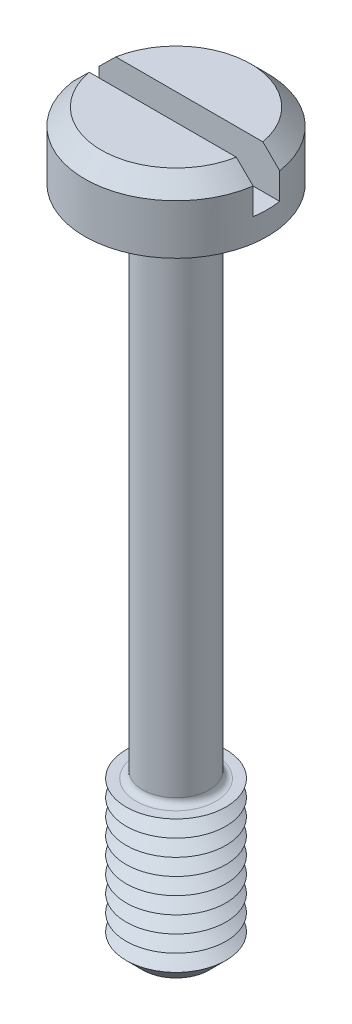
ISO-10303-21;
HEADER;
FILE_DESCRIPTION(('STEP AP214'),'2;1');
FILE_NAME('part.step','',(''),(''),'','','');
FILE_SCHEMA(('AUTOMOTIVE_DESIGN { 1 0 10303 214 1 1 1 1 }'));
ENDSEC;
DATA;
#1=APPLICATION_CONTEXT('core data for automotive mechanical design processes');
#2=APPLICATION_PROTOCOL_DEFINITION('international standard','automotive_design',2000,#1);
#3=PRODUCT_CONTEXT('',#1,'mechanical');
#4=PRODUCT('Part','Part','',(#3));
#5=PRODUCT_RELATED_PRODUCT_CATEGORY('part','',(#4));
#6=PRODUCT_DEFINITION_FORMATION('','',#4);
#7=PRODUCT_DEFINITION_CONTEXT('part definition',#1,'design');
#8=PRODUCT_DEFINITION('design','',#6,#7);
#9=PRODUCT_DEFINITION_SHAPE('','',#8);
#10=(LENGTH_UNIT() NAMED_UNIT(*) SI_UNIT(.MILLI.,.METRE.));
#11=(NAMED_UNIT(*) PLANE_ANGLE_UNIT() SI_UNIT($,.RADIAN.));
#12=(NAMED_UNIT(*) SI_UNIT($,.STERADIAN.) SOLID_ANGLE_UNIT());
#13=UNCERTAINTY_MEASURE_WITH_UNIT(LENGTH_MEASURE(1.E-05),#10,'distance_accuracy_value','');
#14=(GEOMETRIC_REPRESENTATION_CONTEXT(3) GLOBAL_UNCERTAINTY_ASSIGNED_CONTEXT((#13)) GLOBAL_UNIT_ASSIGNED_CONTEXT((#10,
#11,#12)) REPRESENTATION_CONTEXT('',''));
#15=CARTESIAN_POINT('',(0.,0.,0.));
#16=DIRECTION('',(0.,0.,1.));
#17=DIRECTION('',(1.,0.,0.));
#18=AXIS2_PLACEMENT_3D('',#15,#16,#17);
#19=CARTESIAN_POINT('',(0.,2.,0.));
#20=DIRECTION('',(0.,1.,0.));
#21=DIRECTION('',(0.,0.,1.));
#22=AXIS2_PLACEMENT_3D('',#19,#20,#21);
#23=PLANE('',#22);
#24=DIRECTION('',(-1.,0.,0.));
#25=VECTOR('',#24,1.);
#26=CARTESIAN_POINT('',(2.75,2.,-0.4));
#27=LINE('',#26,#25);
#28=CARTESIAN_POINT('',(2.21415898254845,2.,-0.4));
#29=VERTEX_POINT('',#28);
#30=CARTESIAN_POINT('',(-2.21415898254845,2.,-0.4));
#31=VERTEX_POINT('',#30);
#32=EDGE_CURVE('E110',#29,#31,#27,.T.);
#33=ORIENTED_EDGE('',*,*,#32,.F.);
#34=CARTESIAN_POINT('',(0.,2.,0.));
#35=DIRECTION('',(0.,1.,0.));
#36=DIRECTION('',(0.,0.,1.));
#37=AXIS2_PLACEMENT_3D('',#34,#35,#36);
#38=CIRCLE('',#37,2.25);
#39=EDGE_CURVE('E113',#29,#31,#38,.T.);
#40=ORIENTED_EDGE('',*,*,#39,.T.);
#41=EDGE_LOOP('',(#33,#40));
#42=FACE_BOUND('',#41,.T.);
#43=ADVANCED_FACE('F39',(#42),#23,.T.);
#44=CARTESIAN_POINT('',(0.,2.,0.));
#45=DIRECTION('',(0.,-1.,0.));
#46=DIRECTION('',(0.,0.,-1.));
#47=AXIS2_PLACEMENT_3D('',#44,#45,#46);
#48=CONICAL_SURFACE('',#47,2.25,0.785398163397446);
#49=CARTESIAN_POINT('',(6.05060089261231,-1.81380830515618,-0.4));
#50=CARTESIAN_POINT('',(5.84217393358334,-1.60583904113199,-0.4));
#51=CARTESIAN_POINT('',(5.63372707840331,-1.3978896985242,-0.4));
#52=CARTESIAN_POINT('',(5.21676338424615,-0.982052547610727,-0.4));
#53=CARTESIAN_POINT('',(5.00824654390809,-0.774164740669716,-0.4));
#54=CARTESIAN_POINT('',(4.59102343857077,-0.358383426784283,-0.4));
#55=CARTESIAN_POINT('',(4.38231713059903,-0.150489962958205,-0.4));
#56=CARTESIAN_POINT('',(3.96477014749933,0.265153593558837,-0.4));
#57=CARTESIAN_POINT('',(3.75592947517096,0.472903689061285,-0.4));
#58=CARTESIAN_POINT('',(3.33589913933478,0.89028798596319,-0.4));
#59=CARTESIAN_POINT('',(3.12470717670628,1.09991987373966,-0.4));
#60=CARTESIAN_POINT('',(2.7019134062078,1.51879562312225,-0.4));
#61=CARTESIAN_POINT('',(2.49031157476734,1.72803946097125,-0.4));
#62=CARTESIAN_POINT('',(2.17231429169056,2.04123939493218,-0.4));
#63=CARTESIAN_POINT('',(2.06623184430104,2.14551302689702,-0.4));
#64=CARTESIAN_POINT('',(1.85373145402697,2.35372301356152,-0.4));
#65=CARTESIAN_POINT('',(1.74731350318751,2.45765936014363,-0.4));
#66=CARTESIAN_POINT('',(1.53394692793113,2.6649644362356,-0.4));
#67=CARTESIAN_POINT('',(1.42699836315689,2.76833322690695,-0.4));
#68=CARTESIAN_POINT('',(1.26580938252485,2.92258234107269,-0.4));
#69=CARTESIAN_POINT('',(1.21195308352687,2.97386371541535,-0.4));
#70=CARTESIAN_POINT('',(1.10386632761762,3.07603025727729,-0.4));
#71=CARTESIAN_POINT('',(1.0496358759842,3.126915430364,-0.4));
#72=CARTESIAN_POINT('',(0.965529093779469,3.20495157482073,-0.4));
#73=CARTESIAN_POINT('',(0.935852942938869,3.23231811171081,-0.4));
#74=CARTESIAN_POINT('',(0.876282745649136,3.28681446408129,-0.4));
#75=CARTESIAN_POINT('',(0.846388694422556,3.31394427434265,-0.4));
#76=CARTESIAN_POINT('',(0.786319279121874,3.36788760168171,-0.4));
#77=CARTESIAN_POINT('',(0.756143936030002,3.39470114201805,-0.4));
#78=CARTESIAN_POINT('',(0.695411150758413,3.44788757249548,-0.4));
#79=CARTESIAN_POINT('',(0.664853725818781,3.4742604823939,-0.4));
#80=CARTESIAN_POINT('',(0.587773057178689,3.53947080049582,-0.4));
#81=CARTESIAN_POINT('',(0.540923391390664,3.57793090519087,-0.4));
#82=CARTESIAN_POINT('',(0.469108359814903,3.63368803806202,-0.4));
#83=CARTESIAN_POINT('',(0.444902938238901,3.65195872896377,-0.4));
#84=CARTESIAN_POINT('',(0.395796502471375,3.68753467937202,-0.4));
#85=CARTESIAN_POINT('',(0.370895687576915,3.70484021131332,-0.4));
#86=CARTESIAN_POINT('',(0.315135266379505,3.74129905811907,-0.4));
#87=CARTESIAN_POINT('',(0.284069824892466,3.76014262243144,-0.4));
#88=CARTESIAN_POINT('',(0.220007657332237,3.79429188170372,-0.4));
#89=CARTESIAN_POINT('',(0.187014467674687,3.80960381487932,-0.4));
#90=CARTESIAN_POINT('',(0.129469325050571,3.83013103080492,-0.4));
#91=CARTESIAN_POINT('',(0.105533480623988,3.83700748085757,-0.4));
#92=CARTESIAN_POINT('',(0.0568861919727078,3.84667143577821,-0.4));
#93=CARTESIAN_POINT('',(0.0321777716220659,3.84947323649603,-0.4));
#94=CARTESIAN_POINT('',(-0.017455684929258,3.85039131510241,-0.4));
#95=CARTESIAN_POINT('',(-0.0423811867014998,3.84848412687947,-0.4));
#96=CARTESIAN_POINT('',(-0.0915464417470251,3.8403829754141,-0.4));
#97=CARTESIAN_POINT('',(-0.115784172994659,3.83417751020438,-0.4));
#98=CARTESIAN_POINT('',(-0.16401593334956,3.81830420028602,-0.4));
#99=CARTESIAN_POINT('',(-0.18796977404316,3.80851974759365,-0.4));
#100=CARTESIAN_POINT('',(-0.234812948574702,3.78663483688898,-0.4));
#101=CARTESIAN_POINT('',(-0.257700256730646,3.77453017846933,-0.4));
#102=CARTESIAN_POINT('',(-0.302761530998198,3.74868049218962,-0.4));
#103=CARTESIAN_POINT('',(-0.324928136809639,3.73492286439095,-0.4));
#104=CARTESIAN_POINT('',(-0.368536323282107,3.70635481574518,-0.4));
#105=CARTESIAN_POINT('',(-0.389978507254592,3.69154530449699,-0.4));
#106=CARTESIAN_POINT('',(-0.457169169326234,3.64340388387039,-0.4));
#107=CARTESIAN_POINT('',(-0.501937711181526,3.60871473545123,-0.4));
#108=CARTESIAN_POINT('',(-0.590074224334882,3.53759028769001,-0.4));
#109=CARTESIAN_POINT('',(-0.633441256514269,3.50115385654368,-0.4));
#110=CARTESIAN_POINT('',(-0.719371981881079,3.42718980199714,-0.4));
#111=CARTESIAN_POINT('',(-0.761934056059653,3.3896603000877,-0.4));
#112=CARTESIAN_POINT('',(-0.846465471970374,3.31396862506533,-0.4));
#113=CARTESIAN_POINT('',(-0.888434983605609,3.27580664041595,-0.4));
#114=CARTESIAN_POINT('',(-1.01351008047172,3.16091722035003,-0.4));
#115=CARTESIAN_POINT('',(-1.09603733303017,3.0835613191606,-0.4));
#116=CARTESIAN_POINT('',(-1.26020205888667,2.92809304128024,-0.4));
#117=CARTESIAN_POINT('',(-1.3418403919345,2.84998156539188,-0.4));
#118=CARTESIAN_POINT('',(-1.50425180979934,2.69362860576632,-0.4));
#119=CARTESIAN_POINT('',(-1.58502715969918,2.61538947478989,-0.4));
#120=CARTESIAN_POINT('',(-1.74627332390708,2.45859784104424,-0.4));
#121=CARTESIAN_POINT('',(-1.82674413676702,2.38004533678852,-0.4));
#122=CARTESIAN_POINT('',(-2.06785619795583,2.14407469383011,-0.4));
#123=CARTESIAN_POINT('',(-2.22819388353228,1.98634651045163,-0.4));
#124=CARTESIAN_POINT('',(-2.54852691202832,1.67040441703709,-0.4));
#125=CARTESIAN_POINT('',(-2.70852207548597,1.51219032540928,-0.4));
#126=CARTESIAN_POINT('',(-3.02826273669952,1.19551306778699,-0.4));
#127=CARTESIAN_POINT('',(-3.18800823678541,1.03704990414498,-0.4));
#128=CARTESIAN_POINT('',(-3.6669908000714,0.561455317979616,-0.4));
#129=CARTESIAN_POINT('',(-3.98599924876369,0.244093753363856,-0.4));
#130=CARTESIAN_POINT('',(-4.6236988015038,-0.390879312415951,-0.4));
#131=CARTESIAN_POINT('',(-4.94238993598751,-0.708490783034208,-0.4));
#132=CARTESIAN_POINT('',(-5.39262624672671,-1.15743192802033,-0.4));
#133=CARTESIAN_POINT('',(-5.52423897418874,-1.28869385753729,-0.4));
#134=CARTESIAN_POINT('',(-5.78743776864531,-1.5512369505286,-0.4));
#135=CARTESIAN_POINT('',(-5.91902383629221,-1.68251811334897,-0.4));
#136=CARTESIAN_POINT('',(-6.05060089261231,-1.81380830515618,-0.4));
#137=B_SPLINE_CURVE_WITH_KNOTS('',3,(#49,#50,#51,#52,#53,#54,#55,#56,#57,#58,#59,#60,#61,#62,
#63,#64,#65,#66,#67,#68,#69,#70,#71,#72,#73,#74,#75,#76,#77,#78,#79,#80,#81,#82,#83,#84,#85,#86,
#87,#88,#89,#90,#91,#92,#93,#94,#95,#96,#97,#98,#99,#100,#101,#102,#103,#104,#105,#106,#107,
#108,#109,#110,#111,#112,#113,#114,#115,#116,#117,#118,#119,#120,#121,#122,#123,#124,#125,#126,
#127,#128,#129,#130,#131,#132,#133,#134,#135,#136),.UNSPECIFIED.,.F.,.F.,(4,2,2,2,2,2,2,2,2,2,2,
2,2,2,2,2,2,2,2,2,2,2,2,2,2,2,2,2,2,2,2,2,2,2,2,2,2,2,2,2,2,2,2,4),(0.,0.883310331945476,
1.76663897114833,2.6503821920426,3.53410755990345,4.42681573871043,5.31957687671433,
5.76582544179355,6.21208466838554,6.65829482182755,6.88139126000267,7.10448455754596,
7.22558850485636,7.34669511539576,7.46779276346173,7.58888496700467,7.77066509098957,
7.86163037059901,7.95256984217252,8.06146372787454,8.17016376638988,8.24461141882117,
8.31879723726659,8.39335348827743,8.46811002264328,8.54555790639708,8.62314734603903,
8.70137101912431,8.77952785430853,8.94932745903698,9.11923857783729,9.28946128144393,
9.45963414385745,9.79895964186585,10.1379210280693,10.475282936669,10.8126464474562,
11.4873867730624,12.1624208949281,12.8374486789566,14.1873973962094,15.5372009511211,
16.0948428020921,16.6524687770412),.UNSPECIFIED.);
#138=CARTESIAN_POINT('',(2.72075357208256,1.5,-0.4));
#139=VERTEX_POINT('',#138);
#140=EDGE_CURVE('E260',#139,#29,#137,.T.);
#141=ORIENTED_EDGE('',*,*,#140,.F.);
#142=CARTESIAN_POINT('',(0.,1.5,0.));
#143=DIRECTION('',(0.,1.,0.));
#144=DIRECTION('',(0.,0.,1.));
#145=AXIS2_PLACEMENT_3D('',#142,#143,#144);
#146=CIRCLE('',#145,2.75);
#147=CARTESIAN_POINT('',(-2.72075357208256,1.5,-0.4));
#148=VERTEX_POINT('',#147);
#149=EDGE_CURVE('E128',#148,#139,#146,.F.);
#150=ORIENTED_EDGE('',*,*,#149,.F.);
#151=EDGE_CURVE('E102',#31,#148,#137,.T.);
#152=ORIENTED_EDGE('',*,*,#151,.F.);
#153=ORIENTED_EDGE('',*,*,#39,.F.);
#154=EDGE_LOOP('',(#141,#150,#152,#153));
#155=FACE_BOUND('',#154,.T.);
#156=ADVANCED_FACE('F222',(#155),#48,.T.);
#157=CARTESIAN_POINT('',(0.,-20.,0.));
#158=DIRECTION('',(0.,1.,0.));
#159=DIRECTION('',(0.,0.,1.));
#160=AXIS2_PLACEMENT_3D('',#157,#158,#159);
#161=CYLINDRICAL_SURFACE('',#160,1.);
#162=CARTESIAN_POINT('',(0.,-15.3,0.));
#163=DIRECTION('',(0.,-1.,0.));
#164=DIRECTION('',(0.,0.,-1.));
#165=AXIS2_PLACEMENT_3D('',#162,#163,#164);
#166=CIRCLE('',#165,1.);
#167=CARTESIAN_POINT('',(0.,-15.3,-1.));
#168=VERTEX_POINT('',#167);
#169=EDGE_CURVE('E123',#168,#168,#166,.F.);
#170=ORIENTED_EDGE('',*,*,#169,.T.);
#171=EDGE_LOOP('',(#170));
#172=FACE_BOUND('',#171,.T.);
#173=CARTESIAN_POINT('',(0.,-0.199999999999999,0.));
#174=DIRECTION('',(0.,1.,0.));
#175=DIRECTION('',(0.,0.,1.));
#176=AXIS2_PLACEMENT_3D('',#173,#174,#175);
#177=CIRCLE('',#176,1.);
#178=CARTESIAN_POINT('',(0.,-0.199999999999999,1.));
#179=VERTEX_POINT('',#178);
#180=EDGE_CURVE('E366',#179,#179,#177,.F.);
#181=ORIENTED_EDGE('',*,*,#180,.T.);
#182=EDGE_LOOP('',(#181));
#183=FACE_BOUND('',#182,.T.);
#184=ADVANCED_FACE('F218',(#172,#183),#161,.T.);
#185=CARTESIAN_POINT('',(0.,2.,0.));
#186=DIRECTION('',(0.,-1.,0.));
#187=DIRECTION('',(0.,0.,-1.));
#188=AXIS2_PLACEMENT_3D('',#185,#186,#187);
#189=CYLINDRICAL_SURFACE('',#188,2.75);
#190=ORIENTED_EDGE('',*,*,#149,.T.);
#191=DIRECTION('',(0.,-1.,0.));
#192=VECTOR('',#191,1.);
#193=CARTESIAN_POINT('',(2.72075357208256,2.,-0.4));
#194=LINE('',#193,#192);
#195=CARTESIAN_POINT('',(2.72075357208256,0.7,-0.4));
#196=VERTEX_POINT('',#195);
#197=EDGE_CURVE('E64',#139,#196,#194,.T.);
#198=ORIENTED_EDGE('',*,*,#197,.T.);
#199=CARTESIAN_POINT('',(0.,0.7,0.));
#200=DIRECTION('',(0.,1.,0.));
#201=DIRECTION('',(0.,0.,1.));
#202=AXIS2_PLACEMENT_3D('',#199,#200,#201);
#203=CIRCLE('',#202,2.75);
#204=CARTESIAN_POINT('',(2.72075357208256,0.7,0.4));
#205=VERTEX_POINT('',#204);
#206=EDGE_CURVE('E11',#205,#196,#203,.T.);
#207=ORIENTED_EDGE('',*,*,#206,.F.);
#208=DIRECTION('',(0.,-1.,0.));
#209=VECTOR('',#208,1.);
#210=CARTESIAN_POINT('',(2.72075357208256,2.,0.4));
#211=LINE('',#210,#209);
#212=CARTESIAN_POINT('',(2.72075357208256,1.5,0.4));
#213=VERTEX_POINT('',#212);
#214=EDGE_CURVE('E276',#205,#213,#211,.F.);
#215=ORIENTED_EDGE('',*,*,#214,.T.);
#216=CARTESIAN_POINT('',(-2.72075357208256,1.5,0.4));
#217=VERTEX_POINT('',#216);
#218=EDGE_CURVE('E120',#213,#217,#146,.F.);
#219=ORIENTED_EDGE('',*,*,#218,.T.);
#220=DIRECTION('',(0.,-1.,0.));
#221=VECTOR('',#220,1.);
#222=CARTESIAN_POINT('',(-2.72075357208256,2.,0.4));
#223=LINE('',#222,#221);
#224=CARTESIAN_POINT('',(-2.72075357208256,0.7,0.4));
#225=VERTEX_POINT('',#224);
#226=EDGE_CURVE('E96',#217,#225,#223,.T.);
#227=ORIENTED_EDGE('',*,*,#226,.T.);
#228=CARTESIAN_POINT('',(-2.72075357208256,0.7,-0.4));
#229=VERTEX_POINT('',#228);
#230=EDGE_CURVE('E44',#229,#225,#203,.T.);
#231=ORIENTED_EDGE('',*,*,#230,.F.);
#232=DIRECTION('',(0.,-1.,0.));
#233=VECTOR('',#232,1.);
#234=CARTESIAN_POINT('',(-2.72075357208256,2.,-0.4));
#235=LINE('',#234,#233);
#236=EDGE_CURVE('E281',#229,#148,#235,.F.);
#237=ORIENTED_EDGE('',*,*,#236,.T.);
#238=EDGE_LOOP('',(#190,#198,#207,#215,#219,#227,#231,#237));
#239=FACE_BOUND('',#238,.T.);
#240=CARTESIAN_POINT('',(0.,0.,0.));
#241=DIRECTION('',(0.,1.,0.));
#242=DIRECTION('',(0.,0.,1.));
#243=AXIS2_PLACEMENT_3D('',#240,#241,#242);
#244=CIRCLE('',#243,2.75);
#245=CARTESIAN_POINT('',(0.,0.,2.75));
#246=VERTEX_POINT('',#245);
#247=EDGE_CURVE('E355',#246,#246,#244,.T.);
#248=ORIENTED_EDGE('',*,*,#247,.T.);
#249=EDGE_LOOP('',(#248));
#250=FACE_BOUND('',#249,.T.);
#251=ADVANCED_FACE('F221',(#239,#250),#189,.T.);
#252=DIRECTION('',(1.,0.,0.));
#253=VECTOR('',#252,1.);
#254=CARTESIAN_POINT('',(2.75,2.,0.4));
#255=LINE('',#254,#253);
#256=CARTESIAN_POINT('',(-2.21415898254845,2.,0.4));
#257=VERTEX_POINT('',#256);
#258=CARTESIAN_POINT('',(2.21415898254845,2.,0.4));
#259=VERTEX_POINT('',#258);
#260=EDGE_CURVE('E56',#257,#259,#255,.T.);
#261=ORIENTED_EDGE('',*,*,#260,.F.);
#262=EDGE_CURVE('E108',#257,#259,#38,.T.);
#263=ORIENTED_EDGE('',*,*,#262,.T.);
#264=EDGE_LOOP('',(#261,#263));
#265=FACE_BOUND('',#264,.T.);
#266=ADVANCED_FACE('F107',(#265),#23,.T.);
#267=CARTESIAN_POINT('',(0.,0.,0.));
#268=DIRECTION('',(0.,1.,0.));
#269=DIRECTION('',(0.,0.,1.));
#270=AXIS2_PLACEMENT_3D('',#267,#268,#269);
#271=PLANE('',#270);
#272=CARTESIAN_POINT('',(0.,0.,0.));
#273=DIRECTION('',(0.,1.,0.));
#274=DIRECTION('',(0.,0.,1.));
#275=AXIS2_PLACEMENT_3D('',#272,#273,#274);
#276=CIRCLE('',#275,1.2);
#277=CARTESIAN_POINT('',(0.,0.,1.2));
#278=VERTEX_POINT('',#277);
#279=EDGE_CURVE('E114',#278,#278,#276,.T.);
#280=ORIENTED_EDGE('',*,*,#279,.T.);
#281=EDGE_LOOP('',(#280));
#282=FACE_BOUND('',#281,.T.);
#283=ORIENTED_EDGE('',*,*,#247,.F.);
#284=EDGE_LOOP('',(#283));
#285=FACE_BOUND('',#284,.T.);
#286=ADVANCED_FACE('F212',(#282,#285),#271,.F.);
#287=CARTESIAN_POINT('',(0.,-15.5,0.));
#288=DIRECTION('',(0.,-1.,0.));
#289=DIRECTION('',(0.,0.,-1.));
#290=AXIS2_PLACEMENT_3D('',#287,#288,#289);
#291=PLANE('',#290);
#292=CARTESIAN_POINT('',(0.,-15.5,0.));
#293=DIRECTION('',(0.,-1.,0.));
#294=DIRECTION('',(0.,0.,-1.));
#295=AXIS2_PLACEMENT_3D('',#292,#293,#294);
#296=CIRCLE('',#295,1.2);
#297=CARTESIAN_POINT('',(0.,-15.5,-1.2));
#298=VERTEX_POINT('',#297);
#299=EDGE_CURVE('E362',#298,#298,#296,.T.);
#300=ORIENTED_EDGE('',*,*,#299,.T.);
#301=EDGE_LOOP('',(#300));
#302=FACE_BOUND('',#301,.T.);
#303=CARTESIAN_POINT('',(0.,-15.5,0.));
#304=DIRECTION('',(0.,1.,0.));
#305=DIRECTION('',(0.,0.,1.));
#306=AXIS2_PLACEMENT_3D('',#303,#304,#305);
#307=CIRCLE('',#306,1.5);
#308=CARTESIAN_POINT('',(0.,-15.5,1.5));
#309=VERTEX_POINT('',#308);
#310=EDGE_CURVE('E352',#309,#309,#307,.T.);
#311=ORIENTED_EDGE('',*,*,#310,.T.);
#312=EDGE_LOOP('',(#311));
#313=FACE_BOUND('',#312,.T.);
#314=ADVANCED_FACE('F208',(#302,#313),#291,.F.);
#315=CARTESIAN_POINT('',(0.,-15.75,0.));
#316=DIRECTION('',(0.,1.,0.));
#317=DIRECTION('',(0.,0.,1.));
#318=AXIS2_PLACEMENT_3D('',#315,#316,#317);
#319=CONICAL_SURFACE('',#318,1.06698729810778,1.0471975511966);
#320=ORIENTED_EDGE('',*,*,#310,.F.);
#321=EDGE_LOOP('',(#320));
#322=FACE_BOUND('',#321,.T.);
#323=CARTESIAN_POINT('',(0.,-15.75,0.));
#324=DIRECTION('',(0.,1.,0.));
#325=DIRECTION('',(0.,0.,1.));
#326=AXIS2_PLACEMENT_3D('',#323,#324,#325);
#327=CIRCLE('',#326,1.06698729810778);
#328=CARTESIAN_POINT('',(0.,-15.75,1.06698729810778));
#329=VERTEX_POINT('',#328);
#330=EDGE_CURVE('E348',#329,#329,#327,.T.);
#331=ORIENTED_EDGE('',*,*,#330,.T.);
#332=EDGE_LOOP('',(#331));
#333=FACE_BOUND('',#332,.T.);
#334=ADVANCED_FACE('F204',(#322,#333),#319,.T.);
#335=CARTESIAN_POINT('',(0.,-16.,0.));
#336=DIRECTION('',(0.,-1.,0.));
#337=DIRECTION('',(0.,0.,-1.));
#338=AXIS2_PLACEMENT_3D('',#335,#336,#337);
#339=CONICAL_SURFACE('',#338,1.5,1.0471975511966);
#340=ORIENTED_EDGE('',*,*,#330,.F.);
#341=EDGE_LOOP('',(#340));
#342=FACE_BOUND('',#341,.T.);
#343=CARTESIAN_POINT('',(0.,-16.,0.));
#344=DIRECTION('',(0.,1.,0.));
#345=DIRECTION('',(0.,0.,1.));
#346=AXIS2_PLACEMENT_3D('',#343,#344,#345);
#347=CIRCLE('',#346,1.5);
#348=CARTESIAN_POINT('',(0.,-16.,1.5));
#349=VERTEX_POINT('',#348);
#350=EDGE_CURVE('E344',#349,#349,#347,.T.);
#351=ORIENTED_EDGE('',*,*,#350,.T.);
#352=EDGE_LOOP('',(#351));
#353=FACE_BOUND('',#352,.T.);
#354=ADVANCED_FACE('F200',(#342,#353),#339,.T.);
#355=CARTESIAN_POINT('',(0.,-16.25,0.));
#356=DIRECTION('',(0.,1.,0.));
#357=DIRECTION('',(0.,0.,1.));
#358=AXIS2_PLACEMENT_3D('',#355,#356,#357);
#359=CONICAL_SURFACE('',#358,1.06698729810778,1.0471975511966);
#360=ORIENTED_EDGE('',*,*,#350,.F.);
#361=EDGE_LOOP('',(#360));
#362=FACE_BOUND('',#361,.T.);
#363=CARTESIAN_POINT('',(0.,-16.25,0.));
#364=DIRECTION('',(0.,1.,0.));
#365=DIRECTION('',(0.,0.,1.));
#366=AXIS2_PLACEMENT_3D('',#363,#364,#365);
#367=CIRCLE('',#366,1.06698729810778);
#368=CARTESIAN_POINT('',(0.,-16.25,1.06698729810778));
#369=VERTEX_POINT('',#368);
#370=EDGE_CURVE('E340',#369,#369,#367,.T.);
#371=ORIENTED_EDGE('',*,*,#370,.T.);
#372=EDGE_LOOP('',(#371));
#373=FACE_BOUND('',#372,.T.);
#374=ADVANCED_FACE('F196',(#362,#373),#359,.T.);
#375=CARTESIAN_POINT('',(0.,-16.5,0.));
#376=DIRECTION('',(0.,-1.,0.));
#377=DIRECTION('',(0.,0.,-1.));
#378=AXIS2_PLACEMENT_3D('',#375,#376,#377);
#379=CONICAL_SURFACE('',#378,1.5,1.0471975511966);
#380=ORIENTED_EDGE('',*,*,#370,.F.);
#381=EDGE_LOOP('',(#380));
#382=FACE_BOUND('',#381,.T.);
#383=CARTESIAN_POINT('',(0.,-16.5,0.));
#384=DIRECTION('',(0.,1.,0.));
#385=DIRECTION('',(0.,0.,1.));
#386=AXIS2_PLACEMENT_3D('',#383,#384,#385);
#387=CIRCLE('',#386,1.5);
#388=CARTESIAN_POINT('',(0.,-16.5,1.5));
#389=VERTEX_POINT('',#388);
#390=EDGE_CURVE('E336',#389,#389,#387,.T.);
#391=ORIENTED_EDGE('',*,*,#390,.T.);
#392=EDGE_LOOP('',(#391));
#393=FACE_BOUND('',#392,.T.);
#394=ADVANCED_FACE('F192',(#382,#393),#379,.T.);
#395=CARTESIAN_POINT('',(0.,-16.75,0.));
#396=DIRECTION('',(0.,1.,0.));
#397=DIRECTION('',(0.,0.,1.));
#398=AXIS2_PLACEMENT_3D('',#395,#396,#397);
#399=CONICAL_SURFACE('',#398,1.06698729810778,1.0471975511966);
#400=ORIENTED_EDGE('',*,*,#390,.F.);
#401=EDGE_LOOP('',(#400));
#402=FACE_BOUND('',#401,.T.);
#403=CARTESIAN_POINT('',(0.,-16.75,0.));
#404=DIRECTION('',(0.,1.,0.));
#405=DIRECTION('',(0.,0.,1.));
#406=AXIS2_PLACEMENT_3D('',#403,#404,#405);
#407=CIRCLE('',#406,1.06698729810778);
#408=CARTESIAN_POINT('',(0.,-16.75,1.06698729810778));
#409=VERTEX_POINT('',#408);
#410=EDGE_CURVE('E332',#409,#409,#407,.T.);
#411=ORIENTED_EDGE('',*,*,#410,.T.);
#412=EDGE_LOOP('',(#411));
#413=FACE_BOUND('',#412,.T.);
#414=ADVANCED_FACE('F188',(#402,#413),#399,.T.);
#415=CARTESIAN_POINT('',(0.,-17.,0.));
#416=DIRECTION('',(0.,-1.,0.));
#417=DIRECTION('',(0.,0.,-1.));
#418=AXIS2_PLACEMENT_3D('',#415,#416,#417);
#419=CONICAL_SURFACE('',#418,1.5,1.0471975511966);
#420=ORIENTED_EDGE('',*,*,#410,.F.);
#421=EDGE_LOOP('',(#420));
#422=FACE_BOUND('',#421,.T.);
#423=CARTESIAN_POINT('',(0.,-17.,0.));
#424=DIRECTION('',(0.,1.,0.));
#425=DIRECTION('',(0.,0.,1.));
#426=AXIS2_PLACEMENT_3D('',#423,#424,#425);
#427=CIRCLE('',#426,1.5);
#428=CARTESIAN_POINT('',(0.,-17.,1.5));
#429=VERTEX_POINT('',#428);
#430=EDGE_CURVE('E329',#429,#429,#427,.T.);
#431=ORIENTED_EDGE('',*,*,#430,.T.);
#432=EDGE_LOOP('',(#431));
#433=FACE_BOUND('',#432,.T.);
#434=ADVANCED_FACE('F184',(#422,#433),#419,.T.);
#435=CARTESIAN_POINT('',(0.,-17.25,0.));
#436=DIRECTION('',(0.,1.,0.));
#437=DIRECTION('',(0.,0.,1.));
#438=AXIS2_PLACEMENT_3D('',#435,#436,#437);
#439=CONICAL_SURFACE('',#438,1.06698729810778,1.0471975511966);
#440=ORIENTED_EDGE('',*,*,#430,.F.);
#441=EDGE_LOOP('',(#440));
#442=FACE_BOUND('',#441,.T.);
#443=CARTESIAN_POINT('',(0.,-17.25,0.));
#444=DIRECTION('',(0.,1.,0.));
#445=DIRECTION('',(0.,0.,1.));
#446=AXIS2_PLACEMENT_3D('',#443,#444,#445);
#447=CIRCLE('',#446,1.06698729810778);
#448=CARTESIAN_POINT('',(0.,-17.25,1.06698729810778));
#449=VERTEX_POINT('',#448);
#450=EDGE_CURVE('E325',#449,#449,#447,.T.);
#451=ORIENTED_EDGE('',*,*,#450,.T.);
#452=EDGE_LOOP('',(#451));
#453=FACE_BOUND('',#452,.T.);
#454=ADVANCED_FACE('F180',(#442,#453),#439,.T.);
#455=CARTESIAN_POINT('',(0.,-17.5,0.));
#456=DIRECTION('',(0.,-1.,0.));
#457=DIRECTION('',(0.,0.,-1.));
#458=AXIS2_PLACEMENT_3D('',#455,#456,#457);
#459=CONICAL_SURFACE('',#458,1.5,1.0471975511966);
#460=ORIENTED_EDGE('',*,*,#450,.F.);
#461=EDGE_LOOP('',(#460));
#462=FACE_BOUND('',#461,.T.);
#463=CARTESIAN_POINT('',(0.,-17.5,0.));
#464=DIRECTION('',(0.,1.,0.));
#465=DIRECTION('',(0.,0.,1.));
#466=AXIS2_PLACEMENT_3D('',#463,#464,#465);
#467=CIRCLE('',#466,1.5);
#468=CARTESIAN_POINT('',(0.,-17.5,1.5));
#469=VERTEX_POINT('',#468);
#470=EDGE_CURVE('E321',#469,#469,#467,.T.);
#471=ORIENTED_EDGE('',*,*,#470,.T.);
#472=EDGE_LOOP('',(#471));
#473=FACE_BOUND('',#472,.T.);
#474=ADVANCED_FACE('F176',(#462,#473),#459,.T.);
#475=CARTESIAN_POINT('',(0.,-17.75,0.));
#476=DIRECTION('',(0.,1.,0.));
#477=DIRECTION('',(0.,0.,1.));
#478=AXIS2_PLACEMENT_3D('',#475,#476,#477);
#479=CONICAL_SURFACE('',#478,1.06698729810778,1.0471975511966);
#480=ORIENTED_EDGE('',*,*,#470,.F.);
#481=EDGE_LOOP('',(#480));
#482=FACE_BOUND('',#481,.T.);
#483=CARTESIAN_POINT('',(0.,-17.75,0.));
#484=DIRECTION('',(0.,1.,0.));
#485=DIRECTION('',(0.,0.,1.));
#486=AXIS2_PLACEMENT_3D('',#483,#484,#485);
#487=CIRCLE('',#486,1.06698729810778);
#488=CARTESIAN_POINT('',(0.,-17.75,1.06698729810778));
#489=VERTEX_POINT('',#488);
#490=EDGE_CURVE('E317',#489,#489,#487,.T.);
#491=ORIENTED_EDGE('',*,*,#490,.T.);
#492=EDGE_LOOP('',(#491));
#493=FACE_BOUND('',#492,.T.);
#494=ADVANCED_FACE('F172',(#482,#493),#479,.T.);
#495=CARTESIAN_POINT('',(0.,-18.,0.));
#496=DIRECTION('',(0.,-1.,0.));
#497=DIRECTION('',(0.,0.,-1.));
#498=AXIS2_PLACEMENT_3D('',#495,#496,#497);
#499=CONICAL_SURFACE('',#498,1.5,1.0471975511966);
#500=ORIENTED_EDGE('',*,*,#490,.F.);
#501=EDGE_LOOP('',(#500));
#502=FACE_BOUND('',#501,.T.);
#503=CARTESIAN_POINT('',(0.,-18.,0.));
#504=DIRECTION('',(0.,1.,0.));
#505=DIRECTION('',(0.,0.,1.));
#506=AXIS2_PLACEMENT_3D('',#503,#504,#505);
#507=CIRCLE('',#506,1.5);
#508=CARTESIAN_POINT('',(0.,-18.,1.5));
#509=VERTEX_POINT('',#508);
#510=EDGE_CURVE('E313',#509,#509,#507,.T.);
#511=ORIENTED_EDGE('',*,*,#510,.T.);
#512=EDGE_LOOP('',(#511));
#513=FACE_BOUND('',#512,.T.);
#514=ADVANCED_FACE('F168',(#502,#513),#499,.T.);
#515=CARTESIAN_POINT('',(0.,-18.25,0.));
#516=DIRECTION('',(0.,1.,0.));
#517=DIRECTION('',(0.,0.,1.));
#518=AXIS2_PLACEMENT_3D('',#515,#516,#517);
#519=CONICAL_SURFACE('',#518,1.06698729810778,1.0471975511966);
#520=ORIENTED_EDGE('',*,*,#510,.F.);
#521=EDGE_LOOP('',(#520));
#522=FACE_BOUND('',#521,.T.);
#523=CARTESIAN_POINT('',(0.,-18.25,0.));
#524=DIRECTION('',(0.,1.,0.));
#525=DIRECTION('',(0.,0.,1.));
#526=AXIS2_PLACEMENT_3D('',#523,#524,#525);
#527=CIRCLE('',#526,1.06698729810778);
#528=CARTESIAN_POINT('',(0.,-18.25,1.06698729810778));
#529=VERTEX_POINT('',#528);
#530=EDGE_CURVE('E309',#529,#529,#527,.T.);
#531=ORIENTED_EDGE('',*,*,#530,.T.);
#532=EDGE_LOOP('',(#531));
#533=FACE_BOUND('',#532,.T.);
#534=ADVANCED_FACE('F164',(#522,#533),#519,.T.);
#535=CARTESIAN_POINT('',(0.,-18.5,0.));
#536=DIRECTION('',(0.,-1.,0.));
#537=DIRECTION('',(0.,0.,-1.));
#538=AXIS2_PLACEMENT_3D('',#535,#536,#537);
#539=CONICAL_SURFACE('',#538,1.5,1.0471975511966);
#540=ORIENTED_EDGE('',*,*,#530,.F.);
#541=EDGE_LOOP('',(#540));
#542=FACE_BOUND('',#541,.T.);
#543=CARTESIAN_POINT('',(0.,-18.5,0.));
#544=DIRECTION('',(0.,1.,0.));
#545=DIRECTION('',(0.,0.,1.));
#546=AXIS2_PLACEMENT_3D('',#543,#544,#545);
#547=CIRCLE('',#546,1.5);
#548=CARTESIAN_POINT('',(0.,-18.5,1.5));
#549=VERTEX_POINT('',#548);
#550=EDGE_CURVE('E306',#549,#549,#547,.T.);
#551=ORIENTED_EDGE('',*,*,#550,.T.);
#552=EDGE_LOOP('',(#551));
#553=FACE_BOUND('',#552,.T.);
#554=ADVANCED_FACE('F160',(#542,#553),#539,.T.);
#555=CARTESIAN_POINT('',(0.,-18.75,0.));
#556=DIRECTION('',(0.,1.,0.));
#557=DIRECTION('',(0.,0.,1.));
#558=AXIS2_PLACEMENT_3D('',#555,#556,#557);
#559=CONICAL_SURFACE('',#558,1.06698729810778,1.0471975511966);
#560=ORIENTED_EDGE('',*,*,#550,.F.);
#561=EDGE_LOOP('',(#560));
#562=FACE_BOUND('',#561,.T.);
#563=CARTESIAN_POINT('',(0.,-18.75,0.));
#564=DIRECTION('',(0.,1.,0.));
#565=DIRECTION('',(0.,0.,1.));
#566=AXIS2_PLACEMENT_3D('',#563,#564,#565);
#567=CIRCLE('',#566,1.06698729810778);
#568=CARTESIAN_POINT('',(0.,-18.75,1.06698729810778));
#569=VERTEX_POINT('',#568);
#570=EDGE_CURVE('E302',#569,#569,#567,.T.);
#571=ORIENTED_EDGE('',*,*,#570,.T.);
#572=EDGE_LOOP('',(#571));
#573=FACE_BOUND('',#572,.T.);
#574=ADVANCED_FACE('F156',(#562,#573),#559,.T.);
#575=CARTESIAN_POINT('',(0.,-19.,0.));
#576=DIRECTION('',(0.,-1.,0.));
#577=DIRECTION('',(0.,0.,-1.));
#578=AXIS2_PLACEMENT_3D('',#575,#576,#577);
#579=CONICAL_SURFACE('',#578,1.5,1.0471975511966);
#580=ORIENTED_EDGE('',*,*,#570,.F.);
#581=EDGE_LOOP('',(#580));
#582=FACE_BOUND('',#581,.T.);
#583=CARTESIAN_POINT('',(0.,-19.,0.));
#584=DIRECTION('',(0.,1.,0.));
#585=DIRECTION('',(0.,0.,1.));
#586=AXIS2_PLACEMENT_3D('',#583,#584,#585);
#587=CIRCLE('',#586,1.5);
#588=CARTESIAN_POINT('',(0.,-19.,1.5));
#589=VERTEX_POINT('',#588);
#590=EDGE_CURVE('E298',#589,#589,#587,.T.);
#591=ORIENTED_EDGE('',*,*,#590,.T.);
#592=EDGE_LOOP('',(#591));
#593=FACE_BOUND('',#592,.T.);
#594=ADVANCED_FACE('F152',(#582,#593),#579,.T.);
#595=CARTESIAN_POINT('',(0.,-19.25,0.));
#596=DIRECTION('',(0.,1.,0.));
#597=DIRECTION('',(0.,0.,1.));
#598=AXIS2_PLACEMENT_3D('',#595,#596,#597);
#599=CONICAL_SURFACE('',#598,1.06698729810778,1.0471975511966);
#600=ORIENTED_EDGE('',*,*,#590,.F.);
#601=EDGE_LOOP('',(#600));
#602=FACE_BOUND('',#601,.T.);
#603=CARTESIAN_POINT('',(0.,-19.25,0.));
#604=DIRECTION('',(0.,1.,0.));
#605=DIRECTION('',(0.,0.,1.));
#606=AXIS2_PLACEMENT_3D('',#603,#604,#605);
#607=CIRCLE('',#606,1.06698729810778);
#608=CARTESIAN_POINT('',(0.,-19.25,1.06698729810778));
#609=VERTEX_POINT('',#608);
#610=EDGE_CURVE('E294',#609,#609,#607,.T.);
#611=ORIENTED_EDGE('',*,*,#610,.T.);
#612=EDGE_LOOP('',(#611));
#613=FACE_BOUND('',#612,.T.);
#614=ADVANCED_FACE('F148',(#602,#613),#599,.T.);
#615=CARTESIAN_POINT('',(0.,-19.5,0.));
#616=DIRECTION('',(0.,-1.,0.));
#617=DIRECTION('',(0.,0.,-1.));
#618=AXIS2_PLACEMENT_3D('',#615,#616,#617);
#619=CONICAL_SURFACE('',#618,1.5,1.0471975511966);
#620=ORIENTED_EDGE('',*,*,#610,.F.);
#621=EDGE_LOOP('',(#620));
#622=FACE_BOUND('',#621,.T.);
#623=CARTESIAN_POINT('',(0.,-19.5,0.));
#624=DIRECTION('',(0.,1.,0.));
#625=DIRECTION('',(0.,0.,1.));
#626=AXIS2_PLACEMENT_3D('',#623,#624,#625);
#627=CIRCLE('',#626,1.5);
#628=CARTESIAN_POINT('',(0.,-19.5,1.5));
#629=VERTEX_POINT('',#628);
#630=EDGE_CURVE('E290',#629,#629,#627,.T.);
#631=ORIENTED_EDGE('',*,*,#630,.T.);
#632=EDGE_LOOP('',(#631));
#633=FACE_BOUND('',#632,.T.);
#634=ADVANCED_FACE('F144',(#622,#633),#619,.T.);
#635=CARTESIAN_POINT('',(0.,-20.,0.));
#636=DIRECTION('',(0.,-1.,0.));
#637=DIRECTION('',(0.,0.,-1.));
#638=AXIS2_PLACEMENT_3D('',#635,#636,#637);
#639=PLANE('',#638);
#640=CARTESIAN_POINT('',(0.,-20.,0.));
#641=DIRECTION('',(0.,-1.,0.));
#642=DIRECTION('',(0.,0.,-1.));
#643=AXIS2_PLACEMENT_3D('',#640,#641,#642);
#644=CIRCLE('',#643,1.);
#645=CARTESIAN_POINT('',(0.,-20.,-1.));
#646=VERTEX_POINT('',#645);
#647=EDGE_CURVE('E359',#646,#646,#644,.T.);
#648=ORIENTED_EDGE('',*,*,#647,.T.);
#649=EDGE_LOOP('',(#648));
#650=FACE_BOUND('',#649,.T.);
#651=ADVANCED_FACE('F147',(#650),#639,.T.);
#652=CARTESIAN_POINT('',(0.,-20.,0.));
#653=DIRECTION('',(0.,1.,0.));
#654=DIRECTION('',(0.,0.,1.));
#655=AXIS2_PLACEMENT_3D('',#652,#653,#654);
#656=CONICAL_SURFACE('',#655,1.,0.785398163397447);
#657=ORIENTED_EDGE('',*,*,#630,.F.);
#658=EDGE_LOOP('',(#657));
#659=FACE_BOUND('',#658,.T.);
#660=ORIENTED_EDGE('',*,*,#647,.F.);
#661=EDGE_LOOP('',(#660));
#662=FACE_BOUND('',#661,.T.);
#663=ADVANCED_FACE('F216',(#659,#662),#656,.T.);
#664=CARTESIAN_POINT('',(0.,-15.3,0.));
#665=DIRECTION('',(0.,-1.,0.));
#666=DIRECTION('',(0.,0.,-1.));
#667=AXIS2_PLACEMENT_3D('',#664,#665,#666);
#668=TOROIDAL_SURFACE('',#667,1.2,0.2);
#669=ORIENTED_EDGE('',*,*,#169,.F.);
#670=EDGE_LOOP('',(#669));
#671=FACE_BOUND('',#670,.T.);
#672=ORIENTED_EDGE('',*,*,#299,.F.);
#673=EDGE_LOOP('',(#672));
#674=FACE_BOUND('',#673,.T.);
#675=ADVANCED_FACE('F234',(#671,#674),#668,.F.);
#676=CARTESIAN_POINT('',(0.,-0.199999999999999,0.));
#677=DIRECTION('',(0.,1.,0.));
#678=DIRECTION('',(0.,0.,1.));
#679=AXIS2_PLACEMENT_3D('',#676,#677,#678);
#680=TOROIDAL_SURFACE('',#679,1.2,0.2);
#681=ORIENTED_EDGE('',*,*,#279,.F.);
#682=EDGE_LOOP('',(#681));
#683=FACE_BOUND('',#682,.T.);
#684=ORIENTED_EDGE('',*,*,#180,.F.);
#685=EDGE_LOOP('',(#684));
#686=FACE_BOUND('',#685,.T.);
#687=ADVANCED_FACE('F237',(#683,#686),#680,.F.);
#688=CARTESIAN_POINT('',(-6.05060089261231,-1.81380830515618,0.4));
#689=CARTESIAN_POINT('',(-5.84217393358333,-1.60583904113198,0.4));
#690=CARTESIAN_POINT('',(-5.63372707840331,-1.3978896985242,0.4));
#691=CARTESIAN_POINT('',(-5.21676338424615,-0.982052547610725,0.4));
#692=CARTESIAN_POINT('',(-5.00824654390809,-0.774164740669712,0.4));
#693=CARTESIAN_POINT('',(-4.59102343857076,-0.358383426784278,0.4));
#694=CARTESIAN_POINT('',(-4.38231713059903,-0.150489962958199,0.4));
#695=CARTESIAN_POINT('',(-3.96477014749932,0.265153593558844,0.4));
#696=CARTESIAN_POINT('',(-3.75592947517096,0.472903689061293,0.4));
#697=CARTESIAN_POINT('',(-3.33589913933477,0.890287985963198,0.4));
#698=CARTESIAN_POINT('',(-3.12470717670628,1.09991987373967,0.4));
#699=CARTESIAN_POINT('',(-2.7019134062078,1.51879562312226,0.4));
#700=CARTESIAN_POINT('',(-2.49031157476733,1.72803946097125,0.4));
#701=CARTESIAN_POINT('',(-2.17231429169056,2.04123939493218,0.4));
#702=CARTESIAN_POINT('',(-2.06623184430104,2.14551302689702,0.4));
#703=CARTESIAN_POINT('',(-1.85373145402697,2.35372301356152,0.4));
#704=CARTESIAN_POINT('',(-1.74731350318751,2.45765936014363,0.4));
#705=CARTESIAN_POINT('',(-1.53394692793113,2.6649644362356,0.4));
#706=CARTESIAN_POINT('',(-1.42699836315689,2.76833322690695,0.4));
#707=CARTESIAN_POINT('',(-1.26580938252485,2.92258234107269,0.4));
#708=CARTESIAN_POINT('',(-1.21195308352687,2.97386371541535,0.4));
#709=CARTESIAN_POINT('',(-1.10386632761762,3.07603025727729,0.4));
#710=CARTESIAN_POINT('',(-1.0496358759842,3.126915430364,0.4));
#711=CARTESIAN_POINT('',(-0.96552909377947,3.20495157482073,0.4));
#712=CARTESIAN_POINT('',(-0.935852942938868,3.23231811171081,0.4));
#713=CARTESIAN_POINT('',(-0.876282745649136,3.28681446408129,0.4));
#714=CARTESIAN_POINT('',(-0.846388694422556,3.31394427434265,0.4));
#715=CARTESIAN_POINT('',(-0.786319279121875,3.36788760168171,0.4));
#716=CARTESIAN_POINT('',(-0.756143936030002,3.39470114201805,0.4));
#717=CARTESIAN_POINT('',(-0.695411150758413,3.44788757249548,0.4));
#718=CARTESIAN_POINT('',(-0.664853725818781,3.4742604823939,0.4));
#719=CARTESIAN_POINT('',(-0.58777305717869,3.53947080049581,0.4));
#720=CARTESIAN_POINT('',(-0.540923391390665,3.57793090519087,0.4));
#721=CARTESIAN_POINT('',(-0.469108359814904,3.63368803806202,0.4));
#722=CARTESIAN_POINT('',(-0.444902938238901,3.65195872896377,0.4));
#723=CARTESIAN_POINT('',(-0.395796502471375,3.68753467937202,0.4));
#724=CARTESIAN_POINT('',(-0.370895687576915,3.70484021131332,0.4));
#725=CARTESIAN_POINT('',(-0.315135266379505,3.74129905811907,0.4));
#726=CARTESIAN_POINT('',(-0.284069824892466,3.76014262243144,0.4));
#727=CARTESIAN_POINT('',(-0.220007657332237,3.79429188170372,0.4));
#728=CARTESIAN_POINT('',(-0.187014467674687,3.80960381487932,0.4));
#729=CARTESIAN_POINT('',(-0.12946932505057,3.83013103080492,0.4));
#730=CARTESIAN_POINT('',(-0.105533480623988,3.83700748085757,0.4));
#731=CARTESIAN_POINT('',(-0.0568861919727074,3.84667143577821,0.4));
#732=CARTESIAN_POINT('',(-0.0321777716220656,3.84947323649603,0.4));
#733=CARTESIAN_POINT('',(0.0174556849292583,3.85039131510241,0.4));
#734=CARTESIAN_POINT('',(0.0423811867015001,3.84848412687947,0.4));
#735=CARTESIAN_POINT('',(0.0915464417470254,3.8403829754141,0.4));
#736=CARTESIAN_POINT('',(0.115784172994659,3.83417751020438,0.4));
#737=CARTESIAN_POINT('',(0.16401593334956,3.81830420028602,0.4));
#738=CARTESIAN_POINT('',(0.187969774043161,3.80851974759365,0.4));
#739=CARTESIAN_POINT('',(0.234812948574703,3.78663483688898,0.4));
#740=CARTESIAN_POINT('',(0.257700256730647,3.77453017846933,0.4));
#741=CARTESIAN_POINT('',(0.302761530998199,3.74868049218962,0.4));
#742=CARTESIAN_POINT('',(0.32492813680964,3.73492286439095,0.4));
#743=CARTESIAN_POINT('',(0.368536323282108,3.70635481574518,0.4));
#744=CARTESIAN_POINT('',(0.389978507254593,3.69154530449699,0.4));
#745=CARTESIAN_POINT('',(0.457169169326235,3.64340388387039,0.4));
#746=CARTESIAN_POINT('',(0.501937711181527,3.60871473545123,0.4));
#747=CARTESIAN_POINT('',(0.590074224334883,3.53759028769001,0.4));
#748=CARTESIAN_POINT('',(0.633441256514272,3.50115385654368,0.4));
#749=CARTESIAN_POINT('',(0.719371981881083,3.42718980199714,0.4));
#750=CARTESIAN_POINT('',(0.761934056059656,3.3896603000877,0.4));
#751=CARTESIAN_POINT('',(0.846465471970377,3.31396862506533,0.4));
#752=CARTESIAN_POINT('',(0.888434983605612,3.27580664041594,0.4));
#753=CARTESIAN_POINT('',(1.01351008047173,3.16091722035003,0.4));
#754=CARTESIAN_POINT('',(1.09603733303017,3.0835613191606,0.4));
#755=CARTESIAN_POINT('',(1.26020205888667,2.92809304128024,0.4));
#756=CARTESIAN_POINT('',(1.34184039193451,2.84998156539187,0.4));
#757=CARTESIAN_POINT('',(1.50425180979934,2.69362860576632,0.4));
#758=CARTESIAN_POINT('',(1.58502715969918,2.61538947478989,0.4));
#759=CARTESIAN_POINT('',(1.74627332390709,2.45859784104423,0.4));
#760=CARTESIAN_POINT('',(1.82674413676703,2.38004533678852,0.4));
#761=CARTESIAN_POINT('',(2.06785619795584,2.14407469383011,0.4));
#762=CARTESIAN_POINT('',(2.22819388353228,1.98634651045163,0.4));
#763=CARTESIAN_POINT('',(2.54852691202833,1.67040441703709,0.4));
#764=CARTESIAN_POINT('',(2.70852207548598,1.51219032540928,0.4));
#765=CARTESIAN_POINT('',(3.02826273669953,1.19551306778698,0.4));
#766=CARTESIAN_POINT('',(3.18800823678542,1.03704990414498,0.4));
#767=CARTESIAN_POINT('',(3.66699080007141,0.561455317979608,0.4));
#768=CARTESIAN_POINT('',(3.9859992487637,0.244093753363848,0.4));
#769=CARTESIAN_POINT('',(4.62369880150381,-0.39087931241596,0.4));
#770=CARTESIAN_POINT('',(4.94238993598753,-0.708490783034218,0.4));
#771=CARTESIAN_POINT('',(5.39262624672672,-1.15743192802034,0.4));
#772=CARTESIAN_POINT('',(5.52423897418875,-1.28869385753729,0.4));
#773=CARTESIAN_POINT('',(5.78743776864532,-1.5512369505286,0.4));
#774=CARTESIAN_POINT('',(5.91902383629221,-1.68251811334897,0.4));
#775=CARTESIAN_POINT('',(6.05060089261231,-1.81380830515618,0.4));
#776=B_SPLINE_CURVE_WITH_KNOTS('',3,(#688,#689,#690,#691,#692,#693,#694,#695,#696,#697,#698,
#699,#700,#701,#702,#703,#704,#705,#706,#707,#708,#709,#710,#711,#712,#713,#714,#715,#716,#717,
#718,#719,#720,#721,#722,#723,#724,#725,#726,#727,#728,#729,#730,#731,#732,#733,#734,#735,#736,
#737,#738,#739,#740,#741,#742,#743,#744,#745,#746,#747,#748,#749,#750,#751,#752,#753,#754,#755,
#756,#757,#758,#759,#760,#761,#762,#763,#764,#765,#766,#767,#768,#769,#770,#771,#772,#773,#774,
#775),.UNSPECIFIED.,.F.,.F.,(4,2,2,2,2,2,2,2,2,2,2,2,2,2,2,2,2,2,2,2,2,2,2,2,2,2,2,2,2,2,2,2,2,
2,2,2,2,2,2,2,2,2,2,4),(0.,0.883310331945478,1.76663897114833,2.65038219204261,3.53410755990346,
4.42681573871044,5.31957687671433,5.76582544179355,6.21208466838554,6.65829482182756,
6.88139126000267,7.10448455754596,7.22558850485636,7.34669511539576,7.46779276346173,
7.58888496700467,7.77066509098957,7.861630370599,7.95256984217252,8.06146372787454,
8.17016376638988,8.24461141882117,8.31879723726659,8.39335348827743,8.46811002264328,
8.54555790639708,8.62314734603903,8.70137101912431,8.77952785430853,8.94932745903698,
9.1192385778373,9.28946128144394,9.45963414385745,9.79895964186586,10.1379210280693,
10.475282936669,10.8126464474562,11.4873867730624,12.1624208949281,12.8374486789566,
14.1873973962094,15.5372009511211,16.0948428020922,16.6524687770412),.UNSPECIFIED.);
#777=EDGE_CURVE('E92',#217,#257,#776,.T.);
#778=ORIENTED_EDGE('',*,*,#777,.F.);
#779=ORIENTED_EDGE('',*,*,#218,.F.);
#780=EDGE_CURVE('E103',#259,#213,#776,.T.);
#781=ORIENTED_EDGE('',*,*,#780,.F.);
#782=ORIENTED_EDGE('',*,*,#262,.F.);
#783=EDGE_LOOP('',(#778,#779,#781,#782));
#784=FACE_BOUND('',#783,.T.);
#785=ADVANCED_FACE('F41',(#784),#48,.T.);
#786=CARTESIAN_POINT('',(0.,0.7,0.));
#787=DIRECTION('',(0.,1.,0.));
#788=DIRECTION('',(0.,0.,1.));
#789=AXIS2_PLACEMENT_3D('',#786,#787,#788);
#790=PLANE('',#789);
#791=DIRECTION('',(1.,0.,0.));
#792=VECTOR('',#791,1.);
#793=CARTESIAN_POINT('',(2.75,0.7,0.4));
#794=LINE('',#793,#792);
#795=EDGE_CURVE('E257',#225,#205,#794,.T.);
#796=ORIENTED_EDGE('',*,*,#795,.T.);
#797=ORIENTED_EDGE('',*,*,#206,.T.);
#798=DIRECTION('',(-1.,0.,0.));
#799=VECTOR('',#798,1.);
#800=CARTESIAN_POINT('',(2.75,0.7,-0.4));
#801=LINE('',#800,#799);
#802=EDGE_CURVE('E273',#196,#229,#801,.T.);
#803=ORIENTED_EDGE('',*,*,#802,.T.);
#804=ORIENTED_EDGE('',*,*,#230,.T.);
#805=EDGE_LOOP('',(#796,#797,#803,#804));
#806=FACE_BOUND('',#805,.T.);
#807=ADVANCED_FACE('F244',(#806),#790,.T.);
#808=CARTESIAN_POINT('',(2.75,0.7,-0.4));
#809=DIRECTION('',(0.,0.,-1.));
#810=DIRECTION('',(-1.,0.,0.));
#811=AXIS2_PLACEMENT_3D('',#808,#809,#810);
#812=PLANE('',#811);
#813=ORIENTED_EDGE('',*,*,#140,.T.);
#814=ORIENTED_EDGE('',*,*,#32,.T.);
#815=ORIENTED_EDGE('',*,*,#151,.T.);
#816=ORIENTED_EDGE('',*,*,#236,.F.);
#817=ORIENTED_EDGE('',*,*,#802,.F.);
#818=ORIENTED_EDGE('',*,*,#197,.F.);
#819=EDGE_LOOP('',(#813,#814,#815,#816,#817,#818));
#820=FACE_BOUND('',#819,.T.);
#821=ADVANCED_FACE('F141',(#820),#812,.F.);
#822=CARTESIAN_POINT('',(2.75,0.7,0.4));
#823=DIRECTION('',(0.,0.,1.));
#824=DIRECTION('',(1.,0.,0.));
#825=AXIS2_PLACEMENT_3D('',#822,#823,#824);
#826=PLANE('',#825);
#827=ORIENTED_EDGE('',*,*,#777,.T.);
#828=ORIENTED_EDGE('',*,*,#260,.T.);
#829=ORIENTED_EDGE('',*,*,#780,.T.);
#830=ORIENTED_EDGE('',*,*,#214,.F.);
#831=ORIENTED_EDGE('',*,*,#795,.F.);
#832=ORIENTED_EDGE('',*,*,#226,.F.);
#833=EDGE_LOOP('',(#827,#828,#829,#830,#831,#832));
#834=FACE_BOUND('',#833,.T.);
#835=ADVANCED_FACE('F93',(#834),#826,.F.);
#836=CLOSED_SHELL('',(#43,#156,#184,#251,#266,#286,#314,#334,#354,#374,#394,#414,#434,#454,#474,
#494,#514,#534,#554,#574,#594,#614,#634,#651,#663,#675,#687,#785,#807,#821,#835));
#837=MANIFOLD_SOLID_BREP('B2',#836);
#838=ADVANCED_BREP_SHAPE_REPRESENTATION('',(#18,#837),#14);
#839=SHAPE_DEFINITION_REPRESENTATION(#9,#838);
ENDSEC;
END-ISO-10303-21;
